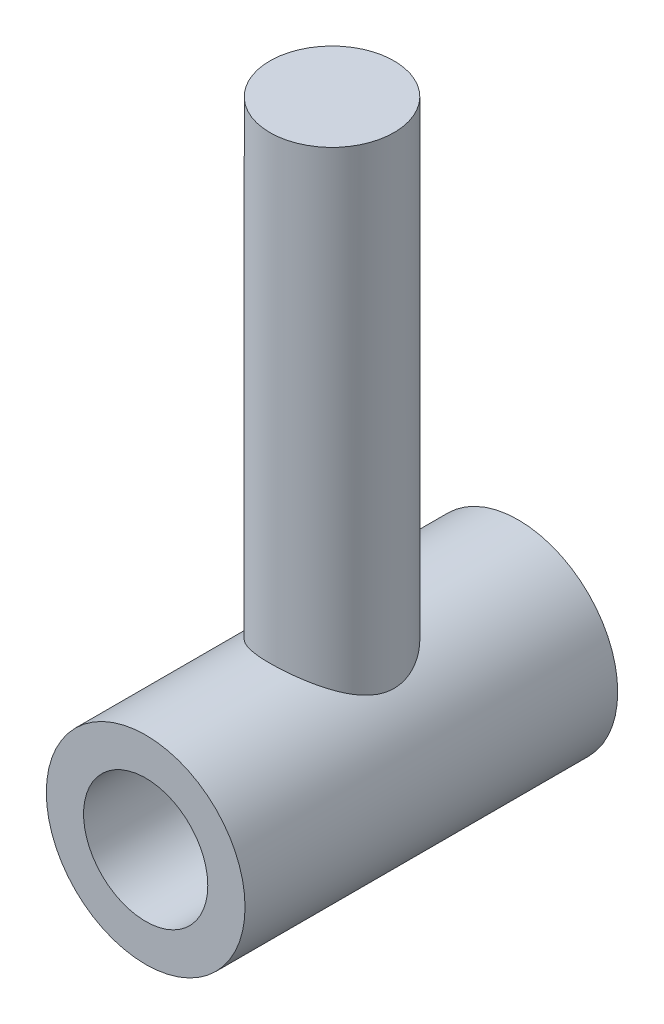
ISO-10303-21;
HEADER;
FILE_DESCRIPTION(('STEP AP214'),'2;1');
FILE_NAME('part.step','',(''),(''),'','','');
FILE_SCHEMA(('AUTOMOTIVE_DESIGN { 1 0 10303 214 1 1 1 1 }'));
ENDSEC;
DATA;
#1=APPLICATION_CONTEXT('core data for automotive mechanical design processes');
#2=APPLICATION_PROTOCOL_DEFINITION('international standard','automotive_design',2000,#1);
#3=PRODUCT_CONTEXT('',#1,'mechanical');
#4=PRODUCT('Part','Part','',(#3));
#5=PRODUCT_RELATED_PRODUCT_CATEGORY('part','',(#4));
#6=PRODUCT_DEFINITION_FORMATION('','',#4);
#7=PRODUCT_DEFINITION_CONTEXT('part definition',#1,'design');
#8=PRODUCT_DEFINITION('design','',#6,#7);
#9=PRODUCT_DEFINITION_SHAPE('','',#8);
#10=(LENGTH_UNIT() NAMED_UNIT(*) SI_UNIT(.MILLI.,.METRE.));
#11=(NAMED_UNIT(*) PLANE_ANGLE_UNIT() SI_UNIT($,.RADIAN.));
#12=(NAMED_UNIT(*) SI_UNIT($,.STERADIAN.) SOLID_ANGLE_UNIT());
#13=UNCERTAINTY_MEASURE_WITH_UNIT(LENGTH_MEASURE(1.E-05),#10,'distance_accuracy_value','');
#14=(GEOMETRIC_REPRESENTATION_CONTEXT(3) GLOBAL_UNCERTAINTY_ASSIGNED_CONTEXT((#13)) GLOBAL_UNIT_ASSIGNED_CONTEXT((#10,
#11,#12)) REPRESENTATION_CONTEXT('',''));
#15=CARTESIAN_POINT('',(0.,0.,0.));
#16=DIRECTION('',(0.,0.,1.));
#17=DIRECTION('',(1.,0.,0.));
#18=AXIS2_PLACEMENT_3D('',#15,#16,#17);
#19=CARTESIAN_POINT('',(0.,0.,15.));
#20=DIRECTION('',(0.,0.,1.));
#21=DIRECTION('',(1.,0.,0.));
#22=AXIS2_PLACEMENT_3D('',#19,#20,#21);
#23=PLANE('',#22);
#24=CARTESIAN_POINT('',(0.,0.,15.));
#25=DIRECTION('',(0.,0.,1.));
#26=DIRECTION('',(1.,0.,0.));
#27=AXIS2_PLACEMENT_3D('',#24,#25,#26);
#28=CIRCLE('',#27,8.);
#29=CARTESIAN_POINT('',(8.,0.,15.));
#30=VERTEX_POINT('',#29);
#31=EDGE_CURVE('E11',#30,#30,#28,.T.);
#32=ORIENTED_EDGE('',*,*,#31,.T.);
#33=EDGE_LOOP('',(#32));
#34=FACE_BOUND('',#33,.T.);
#35=CARTESIAN_POINT('',(0.,0.,15.));
#36=DIRECTION('',(0.,0.,1.));
#37=DIRECTION('',(1.,0.,0.));
#38=AXIS2_PLACEMENT_3D('',#35,#36,#37);
#39=CIRCLE('',#38,5.);
#40=CARTESIAN_POINT('',(5.,0.,15.));
#41=VERTEX_POINT('',#40);
#42=EDGE_CURVE('E48',#41,#41,#39,.T.);
#43=ORIENTED_EDGE('',*,*,#42,.F.);
#44=EDGE_LOOP('',(#43));
#45=FACE_BOUND('',#44,.T.);
#46=ADVANCED_FACE('F37',(#34,#45),#23,.T.);
#47=CARTESIAN_POINT('',(0.,0.,-15.));
#48=DIRECTION('',(0.,0.,1.));
#49=DIRECTION('',(1.,0.,0.));
#50=AXIS2_PLACEMENT_3D('',#47,#48,#49);
#51=PLANE('',#50);
#52=CARTESIAN_POINT('',(0.,0.,-15.));
#53=DIRECTION('',(0.,0.,1.));
#54=DIRECTION('',(1.,0.,0.));
#55=AXIS2_PLACEMENT_3D('',#52,#53,#54);
#56=CIRCLE('',#55,8.);
#57=CARTESIAN_POINT('',(8.,0.,-15.));
#58=VERTEX_POINT('',#57);
#59=EDGE_CURVE('E41',#58,#58,#56,.T.);
#60=ORIENTED_EDGE('',*,*,#59,.F.);
#61=EDGE_LOOP('',(#60));
#62=FACE_BOUND('',#61,.T.);
#63=CARTESIAN_POINT('',(0.,0.,-15.));
#64=DIRECTION('',(0.,0.,1.));
#65=DIRECTION('',(1.,0.,0.));
#66=AXIS2_PLACEMENT_3D('',#63,#64,#65);
#67=CIRCLE('',#66,5.);
#68=CARTESIAN_POINT('',(5.,0.,-15.));
#69=VERTEX_POINT('',#68);
#70=EDGE_CURVE('E50',#69,#69,#67,.T.);
#71=ORIENTED_EDGE('',*,*,#70,.T.);
#72=EDGE_LOOP('',(#71));
#73=FACE_BOUND('',#72,.T.);
#74=ADVANCED_FACE('F81',(#62,#73),#51,.F.);
#75=CARTESIAN_POINT('',(0.,0.,15.));
#76=DIRECTION('',(0.,0.,-1.));
#77=DIRECTION('',(-1.,0.,0.));
#78=AXIS2_PLACEMENT_3D('',#75,#76,#77);
#79=CYLINDRICAL_SURFACE('',#78,8.);
#80=CARTESIAN_POINT('',(0.,8.,5.));
#81=CARTESIAN_POINT('',(0.127079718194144,7.99999969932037,4.999999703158));
#82=CARTESIAN_POINT('',(0.254165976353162,7.99696526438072,4.99514877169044));
#83=CARTESIAN_POINT('',(0.507365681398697,7.98490163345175,4.97581254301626));
#84=CARTESIAN_POINT('',(0.633478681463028,7.97586983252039,4.96132305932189));
#85=CARTESIAN_POINT('',(0.883879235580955,7.95201844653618,4.9228878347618));
#86=CARTESIAN_POINT('',(1.00816396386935,7.93719071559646,4.89892878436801));
#87=CARTESIAN_POINT('',(1.25388007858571,7.90210083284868,4.8418697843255));
#88=CARTESIAN_POINT('',(1.3753102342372,7.88183638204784,4.8087659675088));
#89=CARTESIAN_POINT('',(1.61383677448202,7.83646507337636,4.7340323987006));
#90=CARTESIAN_POINT('',(1.73095311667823,7.81138511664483,4.69244993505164));
#91=CARTESIAN_POINT('',(1.96091650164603,7.75685494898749,4.60110152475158));
#92=CARTESIAN_POINT('',(2.07376186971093,7.7274030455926,4.55133240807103));
#93=CARTESIAN_POINT('',(2.40491190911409,7.63340708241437,4.39050335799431));
#94=CARTESIAN_POINT('',(2.61609848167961,7.5631697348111,4.26783654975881));
#95=CARTESIAN_POINT('',(3.03193014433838,7.40680295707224,3.98444604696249));
#96=CARTESIAN_POINT('',(3.23470598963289,7.31985233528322,3.82146546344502));
#97=CARTESIAN_POINT('',(3.61195776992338,7.1412401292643,3.46710060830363));
#98=CARTESIAN_POINT('',(3.78639500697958,7.04957232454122,3.27567816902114));
#99=CARTESIAN_POINT('',(4.03551059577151,6.90836217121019,2.95571425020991));
#100=CARTESIAN_POINT('',(4.12074022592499,6.85772204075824,2.83571286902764));
#101=CARTESIAN_POINT('',(4.28074637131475,6.75899646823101,2.58784896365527));
#102=CARTESIAN_POINT('',(4.35552092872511,6.71091150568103,2.4599849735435));
#103=CARTESIAN_POINT('',(4.49385262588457,6.61907677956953,2.19711581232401));
#104=CARTESIAN_POINT('',(4.55742717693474,6.57532033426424,2.06212215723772));
#105=CARTESIAN_POINT('',(4.67278116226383,6.49385156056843,1.78537755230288));
#106=CARTESIAN_POINT('',(4.72456056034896,6.45613925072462,1.64362658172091));
#107=CARTESIAN_POINT('',(4.80367778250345,6.39737739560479,1.39186641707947));
#108=CARTESIAN_POINT('',(4.83387146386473,6.37454329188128,1.28316394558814));
#109=CARTESIAN_POINT('',(4.8869893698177,6.33391313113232,1.06308085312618));
#110=CARTESIAN_POINT('',(4.90991524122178,6.31611593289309,0.951700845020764));
#111=CARTESIAN_POINT('',(4.94817199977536,6.28619004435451,0.727023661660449));
#112=CARTESIAN_POINT('',(4.96351189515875,6.27405463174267,0.613728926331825));
#113=CARTESIAN_POINT('',(4.98640391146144,6.25587655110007,0.385858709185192));
#114=CARTESIAN_POINT('',(4.99395573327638,6.24983411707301,0.271283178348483));
#115=CARTESIAN_POINT('',(5.00115324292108,6.24407626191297,0.0414413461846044));
#116=CARTESIAN_POINT('',(5.00077951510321,6.24437637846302,-0.0738259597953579));
#117=CARTESIAN_POINT('',(4.99208386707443,6.2513301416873,-0.30390599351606));
#118=CARTESIAN_POINT('',(4.98375903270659,6.25798611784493,-0.418718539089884));
#119=CARTESIAN_POINT('',(4.95928874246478,6.27739584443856,-0.64702108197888));
#120=CARTESIAN_POINT('',(4.94314081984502,6.29015151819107,-0.760510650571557));
#121=CARTESIAN_POINT('',(4.90327193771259,6.32127805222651,-0.985386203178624));
#122=CARTESIAN_POINT('',(4.87954784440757,6.33965123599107,-1.09677129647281));
#123=CARTESIAN_POINT('',(4.79874186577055,6.40129934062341,-1.42161998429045));
#124=CARTESIAN_POINT('',(4.73140686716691,6.4516270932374,-1.63129247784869));
#125=CARTESIAN_POINT('',(4.57160139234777,6.565824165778,-2.03668208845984));
#126=CARTESIAN_POINT('',(4.47912202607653,6.62969827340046,-2.23239423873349));
#127=CARTESIAN_POINT('',(4.25180409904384,6.77818972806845,-2.64331465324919));
#128=CARTESIAN_POINT('',(4.1122797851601,6.86445305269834,-2.85533520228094));
#129=CARTESIAN_POINT('',(3.80349790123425,7.040239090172,-3.25534918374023));
#130=CARTESIAN_POINT('',(3.63420977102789,7.12976507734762,-3.44331757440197));
#131=CARTESIAN_POINT('',(3.34462792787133,7.26825220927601,-3.7195685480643));
#132=CARTESIAN_POINT('',(3.23332743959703,7.31856628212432,-3.81674280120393));
#133=CARTESIAN_POINT('',(3.00184758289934,7.4165140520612,-4.00135111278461));
#134=CARTESIAN_POINT('',(2.88167150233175,7.464148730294,-4.0887887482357));
#135=CARTESIAN_POINT('',(2.63291547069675,7.55548277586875,-4.25323322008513));
#136=CARTESIAN_POINT('',(2.50433330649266,7.59918109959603,-4.33023729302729));
#137=CARTESIAN_POINT('',(2.23953943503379,7.68138405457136,-4.47292528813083));
#138=CARTESIAN_POINT('',(2.10333250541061,7.71989188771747,-4.53861619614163));
#139=CARTESIAN_POINT('',(1.83158498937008,7.78870197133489,-4.65466886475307));
#140=CARTESIAN_POINT('',(1.69639792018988,7.81933279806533,-4.70566229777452));
#141=CARTESIAN_POINT('',(1.42097512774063,7.87404113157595,-4.79602098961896));
#142=CARTESIAN_POINT('',(1.28074233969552,7.89812238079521,-4.83539289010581));
#143=CARTESIAN_POINT('',(0.996484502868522,7.93899345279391,-4.90186739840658));
#144=CARTESIAN_POINT('',(0.852462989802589,7.95578983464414,-4.92898104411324));
#145=CARTESIAN_POINT('',(0.561915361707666,7.98157299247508,-4.97049034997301));
#146=CARTESIAN_POINT('',(0.415389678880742,7.99056110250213,-4.98488818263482));
#147=CARTESIAN_POINT('',(0.143238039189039,7.99969867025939,-4.999520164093));
#148=CARTESIAN_POINT('',(0.0177414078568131,8.00096292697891,-5.00154086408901));
#149=CARTESIAN_POINT('',(-0.232966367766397,7.99758945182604,-4.9961427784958));
#150=CARTESIAN_POINT('',(-0.358177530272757,7.9929521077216,-4.98872461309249));
#151=CARTESIAN_POINT('',(-0.607327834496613,7.97789005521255,-4.96455622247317));
#152=CARTESIAN_POINT('',(-0.731267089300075,7.96746586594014,-4.94780683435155));
#153=CARTESIAN_POINT('',(-0.976969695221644,7.94108300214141,-4.90520930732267));
#154=CARTESIAN_POINT('',(-1.09873300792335,7.92512423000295,-4.87936100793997));
#155=CARTESIAN_POINT('',(-1.33450834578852,7.88877344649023,-4.82009055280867));
#156=CARTESIAN_POINT('',(-1.44863666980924,7.86858112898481,-4.7870073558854));
#157=CARTESIAN_POINT('',(-1.67350231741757,7.82384532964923,-4.71311096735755));
#158=CARTESIAN_POINT('',(-1.78423846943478,7.79930036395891,-4.67229513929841));
#159=CARTESIAN_POINT('',(-2.11043845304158,7.7198451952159,-4.53885022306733));
#160=CARTESIAN_POINT('',(-2.32007565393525,7.65908557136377,-4.43517728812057));
#161=CARTESIAN_POINT('',(-2.74037159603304,7.51959499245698,-4.1899279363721));
#162=CARTESIAN_POINT('',(-2.94899750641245,7.43966908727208,-4.04558186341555));
#163=CARTESIAN_POINT('',(-3.34056091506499,7.27228030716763,-3.72882840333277));
#164=CARTESIAN_POINT('',(-3.52346945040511,7.1848091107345,-3.55638984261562));
#165=CARTESIAN_POINT('',(-3.88590040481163,6.99623419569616,-3.15945503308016));
#166=CARTESIAN_POINT('',(-4.06107692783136,6.89499476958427,-2.93103560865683));
#167=CARTESIAN_POINT('',(-4.37121122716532,6.70267107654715,-2.44451241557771));
#168=CARTESIAN_POINT('',(-4.50619684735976,6.61157980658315,-2.18642937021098));
#169=CARTESIAN_POINT('',(-4.70739703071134,6.46933988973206,-1.70118604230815));
#170=CARTESIAN_POINT('',(-4.78209607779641,6.41382106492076,-1.47888427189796));
#171=CARTESIAN_POINT('',(-4.87056932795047,6.34656596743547,-1.13643451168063));
#172=CARTESIAN_POINT('',(-4.89612834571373,6.32682054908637,-1.02080987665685));
#173=CARTESIAN_POINT('',(-4.93906627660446,6.29335959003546,-0.787213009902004));
#174=CARTESIAN_POINT('',(-4.95644870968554,6.27964145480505,-0.669241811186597));
#175=CARTESIAN_POINT('',(-4.98283345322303,6.25872646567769,-0.431062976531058));
#176=CARTESIAN_POINT('',(-4.99178464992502,6.25156939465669,-0.310846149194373));
#177=CARTESIAN_POINT('',(-5.00096567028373,6.24422754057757,-0.0698650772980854));
#178=CARTESIAN_POINT('',(-5.00119553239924,6.24404272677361,0.0508991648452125));
#179=CARTESIAN_POINT('',(-4.99292458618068,6.25065867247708,0.29197552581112));
#180=CARTESIAN_POINT('',(-4.98442112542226,6.2574615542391,0.412287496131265));
#181=CARTESIAN_POINT('',(-4.95884706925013,6.27774556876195,0.65139366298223));
#182=CARTESIAN_POINT('',(-4.94177659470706,6.2912266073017,0.770187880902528));
#183=CARTESIAN_POINT('',(-4.88153513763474,6.33822773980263,1.10397138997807));
#184=CARTESIAN_POINT('',(-4.82847742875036,6.37907576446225,1.3162377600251));
#185=CARTESIAN_POINT('',(-4.69670428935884,6.47669777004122,1.728579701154));
#186=CARTESIAN_POINT('',(-4.61797815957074,6.53347839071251,1.92865014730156));
#187=CARTESIAN_POINT('',(-4.42410573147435,6.66655793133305,2.34237556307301));
#188=CARTESIAN_POINT('',(-4.30533683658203,6.74449249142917,2.55380395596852));
#189=CARTESIAN_POINT('',(-4.04000963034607,6.90670498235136,2.9557507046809));
#190=CARTESIAN_POINT('',(-3.89342885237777,6.99098800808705,3.14625195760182));
#191=CARTESIAN_POINT('',(-3.54264024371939,7.17608994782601,3.54008396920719));
#192=CARTESIAN_POINT('',(-3.33276887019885,7.27687640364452,3.73847789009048));
#193=CARTESIAN_POINT('',(-2.99268031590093,7.42018359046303,4.00810023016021));
#194=CARTESIAN_POINT('',(-2.87498419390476,7.4666796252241,4.09337831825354));
#195=CARTESIAN_POINT('',(-2.63162062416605,7.55588019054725,4.25391486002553));
#196=CARTESIAN_POINT('',(-2.50595739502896,7.59858669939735,4.32917855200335));
#197=CARTESIAN_POINT('',(-2.24695585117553,7.67916888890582,4.46910627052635));
#198=CARTESIAN_POINT('',(-2.11359966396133,7.71703260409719,4.53374415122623));
#199=CARTESIAN_POINT('',(-1.8403912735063,7.78670745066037,4.65135006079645));
#200=CARTESIAN_POINT('',(-1.70054287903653,7.81852207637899,4.70432482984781));
#201=CARTESIAN_POINT('',(-1.415749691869,7.87506644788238,4.79771288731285));
#202=CARTESIAN_POINT('',(-1.27081981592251,7.89981525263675,4.83815999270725));
#203=CARTESIAN_POINT('',(-0.976912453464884,7.9415135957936,4.90595103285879));
#204=CARTESIAN_POINT('',(-0.827938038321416,7.95846888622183,4.93330463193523));
#205=CARTESIAN_POINT('',(-0.565708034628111,7.98076605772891,4.96918150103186));
#206=CARTESIAN_POINT('',(-0.453012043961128,7.98796542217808,4.98072550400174));
#207=CARTESIAN_POINT('',(-0.226879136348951,7.99758267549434,4.99613512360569));
#208=CARTESIAN_POINT('',(-0.113442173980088,8.00000026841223,5.00000026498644));
#209=CARTESIAN_POINT('',(0.,8.,5.));
#210=B_SPLINE_CURVE_WITH_KNOTS('',3,(#80,#81,#82,#83,#84,#85,#86,#87,#88,#89,#90,#91,#92,#93,
#94,#95,#96,#97,#98,#99,#100,#101,#102,#103,#104,#105,#106,#107,#108,#109,#110,#111,#112,#113,
#114,#115,#116,#117,#118,#119,#120,#121,#122,#123,#124,#125,#126,#127,#128,#129,#130,#131,#132,
#133,#134,#135,#136,#137,#138,#139,#140,#141,#142,#143,#144,#145,#146,#147,#148,#149,#150,#151,
#152,#153,#154,#155,#156,#157,#158,#159,#160,#161,#162,#163,#164,#165,#166,#167,#168,#169,#170,
#171,#172,#173,#174,#175,#176,#177,#178,#179,#180,#181,#182,#183,#184,#185,#186,#187,#188,#189,
#190,#191,#192,#193,#194,#195,#196,#197,#198,#199,#200,#201,#202,#203,#204,#205,#206,#207,#208,
#209),.UNSPECIFIED.,.T.,.F.,(4,2,2,2,2,2,2,2,2,2,2,2,2,2,2,2,2,2,2,2,2,2,2,2,2,2,2,2,2,2,2,2,2,
2,2,2,2,2,2,2,2,2,2,2,2,2,2,2,2,2,2,2,2,2,2,2,2,2,2,2,2,2,2,2,4),(0.,0.381122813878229,
0.762411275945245,1.14423755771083,1.52622555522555,1.90613865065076,2.2861992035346,
3.04547146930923,3.86537873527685,4.68639638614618,5.15288943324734,5.61946971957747,
6.08531814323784,6.55116799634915,6.89615022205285,7.24105422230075,7.58554766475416,
7.93005433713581,8.27540506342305,8.62088241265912,8.96646876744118,9.31219825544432,
9.98712845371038,10.6622975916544,11.463592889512,12.2657157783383,12.7334704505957,
13.2010527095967,13.6687585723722,14.1361745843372,14.5786070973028,15.0207862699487,
15.4625664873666,15.9042712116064,16.280349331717,16.6564027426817,17.0324224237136,
17.4084487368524,17.7696430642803,18.1309607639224,18.8530325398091,19.6479898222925,
20.4438353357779,21.355208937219,22.2659496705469,22.9857781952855,23.3455439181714,
23.705154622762,24.0669316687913,24.4287071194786,24.7905924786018,25.1524727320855,
25.8172983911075,26.482401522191,27.2437925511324,28.005801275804,28.9187931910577,
29.3761295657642,29.8332257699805,30.2914303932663,30.7493695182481,31.2060614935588,
31.6624158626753,32.0026174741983,32.3428401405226),.UNSPECIFIED.);
#211=CARTESIAN_POINT('',(0.,8.,5.));
#212=VERTEX_POINT('',#211);
#213=EDGE_CURVE('E53',#212,#212,#210,.T.);
#214=ORIENTED_EDGE('',*,*,#213,.F.);
#215=EDGE_LOOP('',(#214));
#216=FACE_BOUND('',#215,.T.);
#217=ORIENTED_EDGE('',*,*,#31,.F.);
#218=EDGE_LOOP('',(#217));
#219=FACE_BOUND('',#218,.T.);
#220=ORIENTED_EDGE('',*,*,#59,.T.);
#221=EDGE_LOOP('',(#220));
#222=FACE_BOUND('',#221,.T.);
#223=ADVANCED_FACE('F39',(#216,#219,#222),#79,.T.);
#224=CARTESIAN_POINT('',(0.,0.,15.));
#225=DIRECTION('',(0.,0.,-1.));
#226=DIRECTION('',(-1.,0.,0.));
#227=AXIS2_PLACEMENT_3D('',#224,#225,#226);
#228=CYLINDRICAL_SURFACE('',#227,5.);
#229=ORIENTED_EDGE('',*,*,#42,.T.);
#230=EDGE_LOOP('',(#229));
#231=FACE_BOUND('',#230,.T.);
#232=ORIENTED_EDGE('',*,*,#70,.F.);
#233=EDGE_LOOP('',(#232));
#234=FACE_BOUND('',#233,.T.);
#235=ADVANCED_FACE('F71',(#231,#234),#228,.F.);
#236=CARTESIAN_POINT('',(0.,45.,0.));
#237=DIRECTION('',(0.,1.,0.));
#238=DIRECTION('',(0.,0.,1.));
#239=AXIS2_PLACEMENT_3D('',#236,#237,#238);
#240=PLANE('',#239);
#241=CARTESIAN_POINT('',(0.,45.,0.));
#242=DIRECTION('',(0.,1.,0.));
#243=DIRECTION('',(0.,0.,1.));
#244=AXIS2_PLACEMENT_3D('',#241,#242,#243);
#245=CIRCLE('',#244,5.);
#246=CARTESIAN_POINT('',(0.,45.,5.));
#247=VERTEX_POINT('',#246);
#248=EDGE_CURVE('E63',#247,#247,#245,.T.);
#249=ORIENTED_EDGE('',*,*,#248,.T.);
#250=EDGE_LOOP('',(#249));
#251=FACE_BOUND('',#250,.T.);
#252=ADVANCED_FACE('F69',(#251),#240,.T.);
#253=CARTESIAN_POINT('',(0.,-8.001,0.));
#254=DIRECTION('',(0.,1.,0.));
#255=DIRECTION('',(0.,0.,1.));
#256=AXIS2_PLACEMENT_3D('',#253,#254,#255);
#257=CYLINDRICAL_SURFACE('',#256,5.);
#258=ORIENTED_EDGE('',*,*,#248,.F.);
#259=EDGE_LOOP('',(#258));
#260=FACE_BOUND('',#259,.T.);
#261=ORIENTED_EDGE('',*,*,#213,.T.);
#262=EDGE_LOOP('',(#261));
#263=FACE_BOUND('',#262,.T.);
#264=ADVANCED_FACE('F64',(#260,#263),#257,.T.);
#265=CLOSED_SHELL('',(#46,#74,#223,#235,#252,#264));
#266=MANIFOLD_SOLID_BREP('B2',#265);
#267=ADVANCED_BREP_SHAPE_REPRESENTATION('',(#18,#266),#14);
#268=SHAPE_DEFINITION_REPRESENTATION(#9,#267);
ENDSEC;
END-ISO-10303-21;
